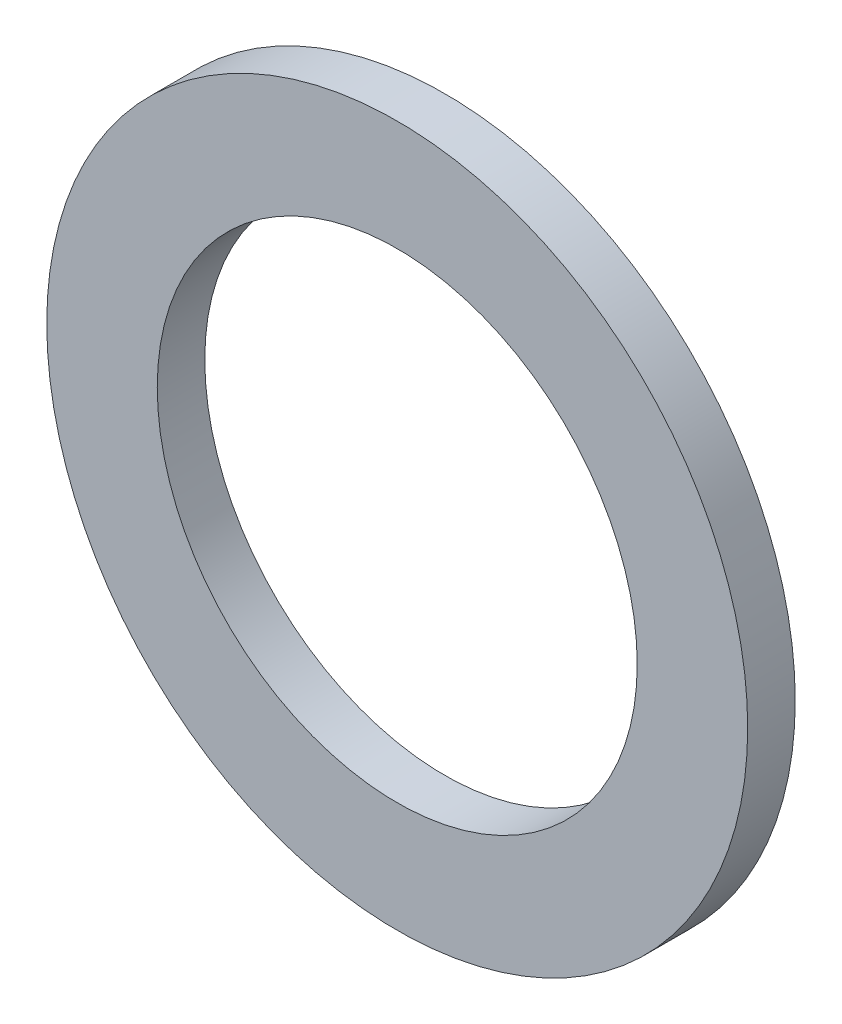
from build123d import *

# Parameters (mm, degrees)
ESQUISSE2_R          = 7.375
ESQUISSE2_R_2        = 5.05
BASE_EXTRUSION_DEPTH = 1


with BuildPart() as part:
    # Esquisse2 → Base-Extrusion (new body)
    with BuildSketch(Plane.XY.offset(2.5)):
        with Locations((16.875, 26.978357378)):
            Circle(ESQUISSE2_R)
        with Locations((16.875, 26.978357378)):
            Circle(ESQUISSE2_R_2, mode=Mode.SUBTRACT)
    extrude(amount=BASE_EXTRUSION_DEPTH)


solid = part.part
